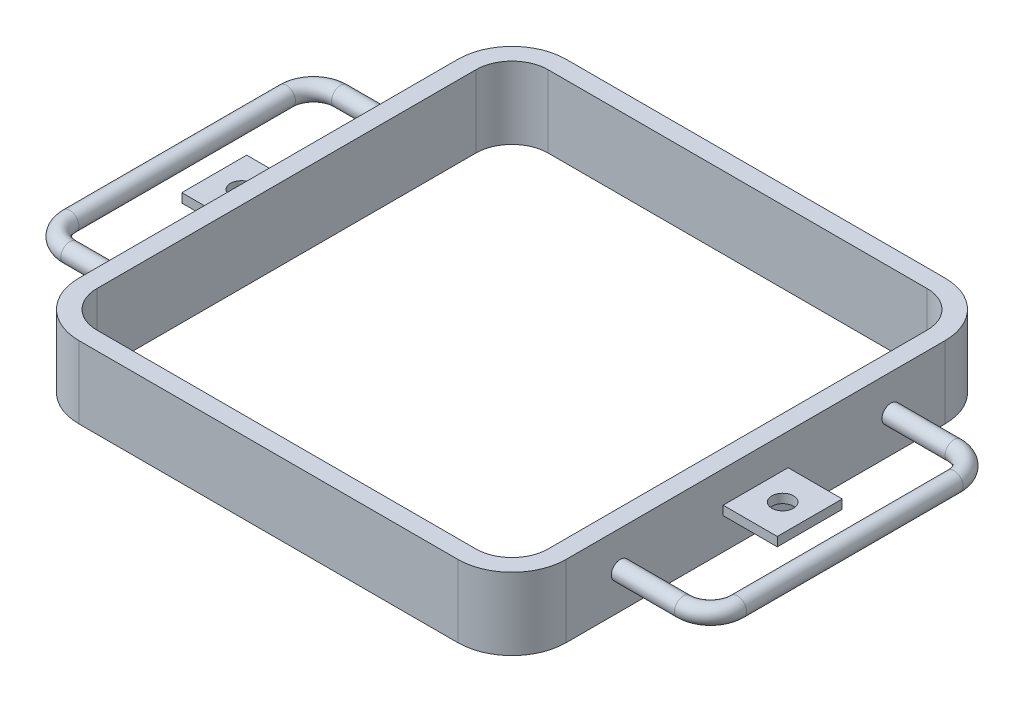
from build123d import *

# Parameters (mm, degrees)
BOSS_EXTRUDE1_DEPTH = 20
SKETCH4_R           = 5
SKETCH5_W           = 30
SKETCH5_H           = 36
SKETCH5_R           = 6
BOSS_EXTRUDE3_DEPTH = 2.5


with BuildPart() as part:
    # Sketch1 → Boss-Extrude1 (new, symmetric)
    with BuildSketch(Plane(origin=(0, 0, 0), x_dir=(1, 0, 0), z_dir=(0, 1, 0))):
        with BuildLine():
            Line((-135, 105), (-135, -105))
            ThreePointArc((-135, -105), (-126.213203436, -126.213203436), (-105, -135))
            Line((-105, -135), (105, -135))
            ThreePointArc((105, -135), (126.213203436, -126.213203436), (135, -105))
            Line((135, -105), (135, 105))
            ThreePointArc((135, 105), (126.213203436, 126.213203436), (105, 135))
            Line((105, 135), (-105, 135))
            ThreePointArc((-105, 135), (-126.213203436, 126.213203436), (-135, 105))
        make_face()
        with BuildLine():
            Line((-105, 125), (105, 125))
            ThreePointArc((105, 125), (119.142135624, 119.142135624), (125, 105))
            Line((125, 105), (125, -105))
            ThreePointArc((125, -105), (119.142135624, -119.142135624), (105, -125))
            Line((105, -125), (-105, -125))
            ThreePointArc((-105, -125), (-119.142135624, -119.142135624), (-125, -105))
            Line((-125, -105), (-125, 105))
            ThreePointArc((-125, 105), (-119.142135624, 119.142135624), (-105, 125))
        make_face(mode=Mode.SUBTRACT)
    extrude(amount=BOSS_EXTRUDE1_DEPTH, both=True)

    # Sweep1: sweep along a path in Sketch3
    with BuildLine(Plane(origin=(0, 0, 0), x_dir=(1, 0, 0), z_dir=(0, 1, 0))) as sweep1_path:
        Line((-135, -75), (-170, -75))
        ThreePointArc((-170, -75), (-180.606601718, -70.606601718), (-185, -60))
        Line((-185, -60), (-185, 60))
        ThreePointArc((-185, 60), (-180.606601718, 70.606601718), (-170, 75))
        Line((-170, 75), (-135, 75))
    # Sketch4 → Sweep1 (sweep)
    with BuildSketch(Plane(origin=(-135, 0, 75), x_dir=(0, 0, 1), z_dir=(-1, 0, 0))):
        Circle(SKETCH4_R)
    sweep1 = sweep(path=sweep1_path.line)

    # Sketch5 → Boss-Extrude3 (add, symmetric)
    with BuildSketch(Plane(origin=(0, 0, 0), x_dir=(1, 0, 0), z_dir=(0, 1, 0))):
        with Locations((-150, 0)):
            Rectangle(SKETCH5_W, SKETCH5_H)
        with Locations(Location((-150, 0, 0), (0, 0, 270))):
            Circle(SKETCH5_R, mode=Mode.SUBTRACT)
    boss_extrude3 = extrude(amount=BOSS_EXTRUDE3_DEPTH, both=True)

    # Mirror1: Sweep1, Boss-Extrude3 across plane
    add(sweep1.mirror(Plane(origin=(0, 0, 0), x_dir=(0, 0, 1), z_dir=(1, 0, 0))))
    add(boss_extrude3.mirror(Plane(origin=(0, 0, 0), x_dir=(0, 0, 1), z_dir=(1, 0, 0))))


solid = part.part
